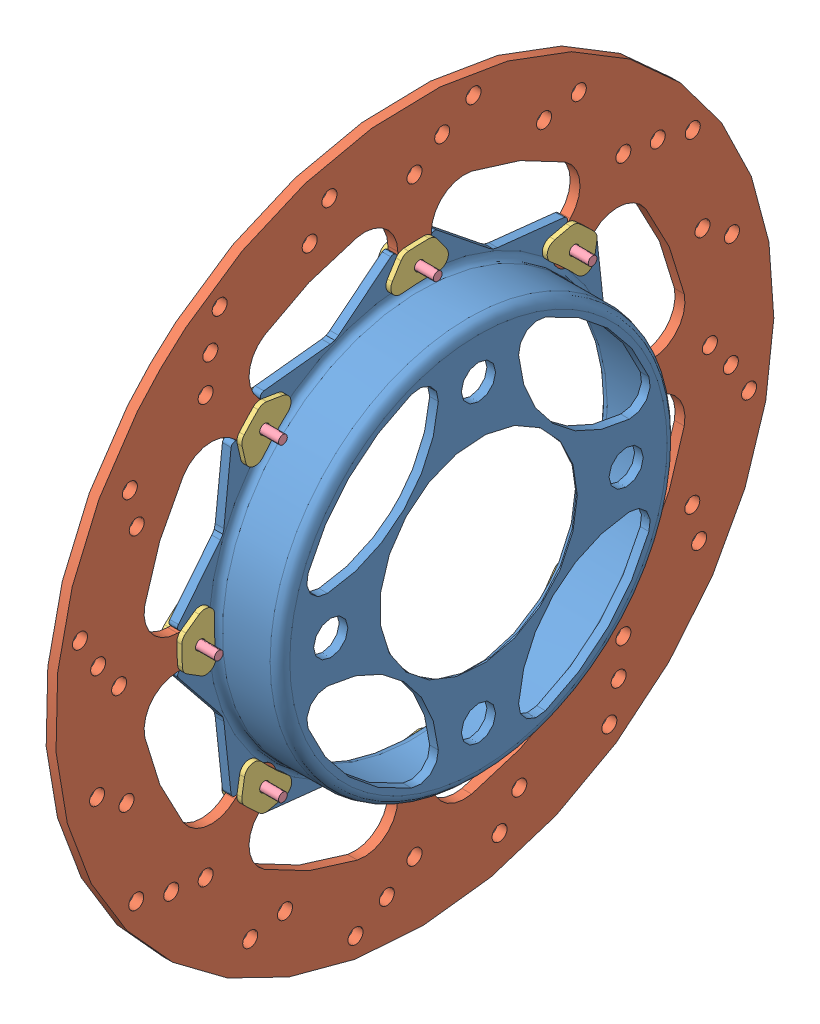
SolidWorks assembly Brake Rotor Assembly_Final.SLDASM, configuration Default (file format 13000). Lengths in mm.
Overall size (25.91 327.78 327.78).
26 component instances, 4 part files, 10 mates.
Components (placement in the parent):
- Rotor Hat_Final-1: Rotor Hat_Final.SLDPRT [Default] at (-34.2242 30.4071 -2.5985) size (23.6 152.4 152.4)
- Rotor - Cast Iron_Final-1: Rotor - Cast Iron_Final.SLDPRT [Default] at (-31.2397 30.4071 -2.5985) x (0 0.707107 0.707107) z (-1 0 0) size (231.78 231.78 3.17)
- Rotor Washer_Final-1: Rotor Washer_Final.SLDPRT [Default] at (-31.2397 33.0101 -12.653) x (0 0.99948 0.032253) z (1 0 0) size (18.57 10.78 1.59)
- Rotor Washer_Final-27: Rotor Washer_Final.SLDPRT [Chamfer] at (-34.4147 41.3596 -11.9484) x (0 -0.990749 -0.135705) z (-1 0 0) size (18.57 10.78 1.59)
- Rotor Pin_Final-6: Rotor Pin_Final.SLDPRT [.5] at (-34.9647 30.4071 68.0135) x (0 0.996402 -0.084747) z (-1 0 0) size (6.36 6.36 12.79)
- Rotor Washer_Final-13: Rotor Washer_Final.SLDPRT [Default] at (-31.2397 25.1381 -11.5488) x (0 0.729545 -0.683933) z (1 0 0) size (18.57 10.78 1.59)
- Rotor Washer_Final-14: Rotor Washer_Final.SLDPRT [Default] at (-31.2397 20.3526 -5.2016) x (0 0.032253 -0.99948) z (1 0 0) size (18.57 10.78 1.59)
- Rotor Washer_Final-15: Rotor Washer_Final.SLDPRT [Default] at (-31.2397 21.4568 2.6705) x (0 -0.683933 -0.729545) z (1 0 0) size (18.57 10.78 1.59)
- Rotor Washer_Final-16: Rotor Washer_Final.SLDPRT [Default] at (-31.2397 27.804 7.456) x (0 -0.99948 -0.032253) z (1 0 0) size (18.57 10.78 1.59)
- Rotor Washer_Final-17: Rotor Washer_Final.SLDPRT [Default] at (-31.2397 35.676 6.3518) x (0 -0.729545 0.683933) z (1 0 0) size (18.57 10.78 1.59)
- Rotor Pin_Final-7: Rotor Pin_Final.SLDPRT [.5] at (-34.9647 80.3373 47.3317) x (0 0.644638 -0.764488) z (-1 0 0) size (6.36 6.36 12.79)
- Rotor Pin_Final-8: Rotor Pin_Final.SLDPRT [.5] at (-34.9647 101.0191 -2.5985) x (0 -0.084747 -0.996402) z (-1 0 0) size (6.36 6.36 12.79)
- Rotor Pin_Final-9: Rotor Pin_Final.SLDPRT [.5] at (-34.9647 80.3373 -52.5287) x (0 -0.764488 -0.644638) z (-1 0 0) size (6.36 6.36 12.79)
- Rotor Pin_Final-10: Rotor Pin_Final.SLDPRT [.5] at (-34.9647 30.4071 -73.2105) x (0 -0.996402 0.084747) z (-1 0 0) size (6.36 6.36 12.79)
- Rotor Pin_Final-11: Rotor Pin_Final.SLDPRT [.5] at (-34.9647 -19.5231 -52.5287) x (0 -0.644638 0.764488) z (-1 0 0) size (6.36 6.36 12.79)
- Rotor Pin_Final-12: Rotor Pin_Final.SLDPRT [.5] at (-34.9647 -40.2049 -2.5985) x (0 0.084747 0.996402) z (-1 0 0) size (6.36 6.36 12.79)
- Rotor Pin_Final-13: Rotor Pin_Final.SLDPRT [.5] at (-34.9647 -19.5231 47.3317) x (0 0.764488 0.644638) z (-1 0 0) size (6.36 6.36 12.79)
- Rotor Washer_Final-25: Rotor Washer_Final.SLDPRT [Default] at (-31.2397 40.4616 0.0046) x (0 -0.032253 0.99948) z (1 0 0) size (18.57 10.78 1.59)
- Rotor Washer_Final-26: Rotor Washer_Final.SLDPRT [Default] at (-31.2397 39.3573 -7.8675) x (0 0.683933 0.729545) z (1 0 0) size (18.57 10.78 1.59)
- Rotor Washer_Final-28: Rotor Washer_Final.SLDPRT [Chamfer] at (-34.4147 31.5403 -16.9545) x (0 -0.796524 0.604608) z (-1 0 0) size (18.57 10.78 1.59)
- Rotor Washer_Final-29: Rotor Washer_Final.SLDPRT [Chamfer] at (-34.4147 21.0572 -13.551) x (0 -0.135705 0.990749) z (-1 0 0) size (18.57 10.78 1.59)
- Rotor Washer_Final-30: Rotor Washer_Final.SLDPRT [Chamfer] at (-34.4147 16.0511 -3.7317) x (0 0.604608 0.796524) z (-1 0 0) size (18.57 10.78 1.59)
- Rotor Washer_Final-31: Rotor Washer_Final.SLDPRT [Chamfer] at (-34.4147 19.4545 6.7514) x (0 0.990749 0.135705) z (-1 0 0) size (18.57 10.78 1.59)
- Rotor Washer_Final-32: Rotor Washer_Final.SLDPRT [Chamfer] at (-34.4147 29.2738 11.7575) x (0 0.796524 -0.604608) z (-1 0 0) size (18.57 10.78 1.59)
- Rotor Washer_Final-33: Rotor Washer_Final.SLDPRT [Chamfer] at (-34.4147 39.757 8.3541) x (0 0.135705 -0.990749) z (-1 0 0) size (18.57 10.78 1.59)
- Rotor Washer_Final-34: Rotor Washer_Final.SLDPRT [Chamfer] at (-34.4147 44.7631 -1.4652) x (0 -0.604608 -0.796524) z (-1 0 0) size (18.57 10.78 1.59)
Mates (geometry in assembly coordinates):
- Coincident1: coincident anti-aligned: plane of Rotor - Cast Iron_Final-1 through (-31.2387 -46.001 2.799) normal (0 0 1); plane of Rotor Hat_Final-1 through (-10.6199 -44.5229 2.799) normal (0 0 -1)
- Distance1: distance = 0.1905 mm aligned: plane of Rotor Hat_Final-1 through (-34.2242 95.5581 -2.5985) normal (-1 0 0); plane of assembly through (-34.4147 -149.9716 177.7802) normal (-1 0 0)
- Distance2: distance = 0.1905 mm aligned: plane of Rotor Hat_Final-1 through (-34.2242 95.5581 -2.5985) normal (-1 0 0); plane of Rotor - Cast Iron_Final-1 through (-34.4147 -149.9716 177.7802) normal (-1 0 0)
- Coincident3: coincident anti-aligned: plane of Rotor - Cast Iron_Final-1 through (-31.2397 -149.9716 177.7802) normal (1 0 0); plane of Rotor Washer_Final-1 through (-31.2397 33.4923 70.8481) normal (-1 0 0)
- Concentric4: concentric aligned: cylinder of Rotor Washer_Final-1 through (-29.6522 30.4071 68.0135) axis (-1 0 0) radius 1.5875; cylinder of Rotor - Cast Iron_Final-1 through (-31.2387 30.4071 68.0135) axis (-1 0 0) radius 1.5875
- Coincident5: coincident anti-aligned: plane of Rotor - Cast Iron_Final-1 through (-34.4147 -149.9716 177.7802) normal (-1 0 0); plane of Rotor Washer_Final-27 through (-34.4147 26.8905 70.291) normal (1 0 0)
- Concentric9: concentric anti-aligned: cylinder of Rotor Pin_Final-6 through (-34.9647 30.4071 68.0135) axis (1 0 0) radius 1.4224; cylinder of Rotor - Cast Iron_Final-1 through (-31.2387 30.4071 68.0135) axis (-1 0 0) radius 1.5875
- Coincident6: coincident aligned: cone of Rotor Washer_Final-27 through (-34.5412 30.4071 68.0135) axis (1 0 0); cone of Rotor Pin_Final-6 through (-36.4405 30.4071 68.0135) axis (1 0 0)
- Concentric12: concentric aligned: cylinder of Rotor - Cast Iron_Final-1 through (-34.4147 30.4071 -2.5985) axis (1 0 0) radius 115.8875; circle of Rotor Hat_Final-1
- Concentric13: concentric aligned: cylinder of Rotor - Cast Iron_Final-1 through (-34.4147 30.4071 -2.5985) axis (1 0 0) radius 115.8875; cylinder of Rotor Hat_Final-1 through (-8.3543 30.4071 -2.5985) axis (1 0 0) radius 64.008
